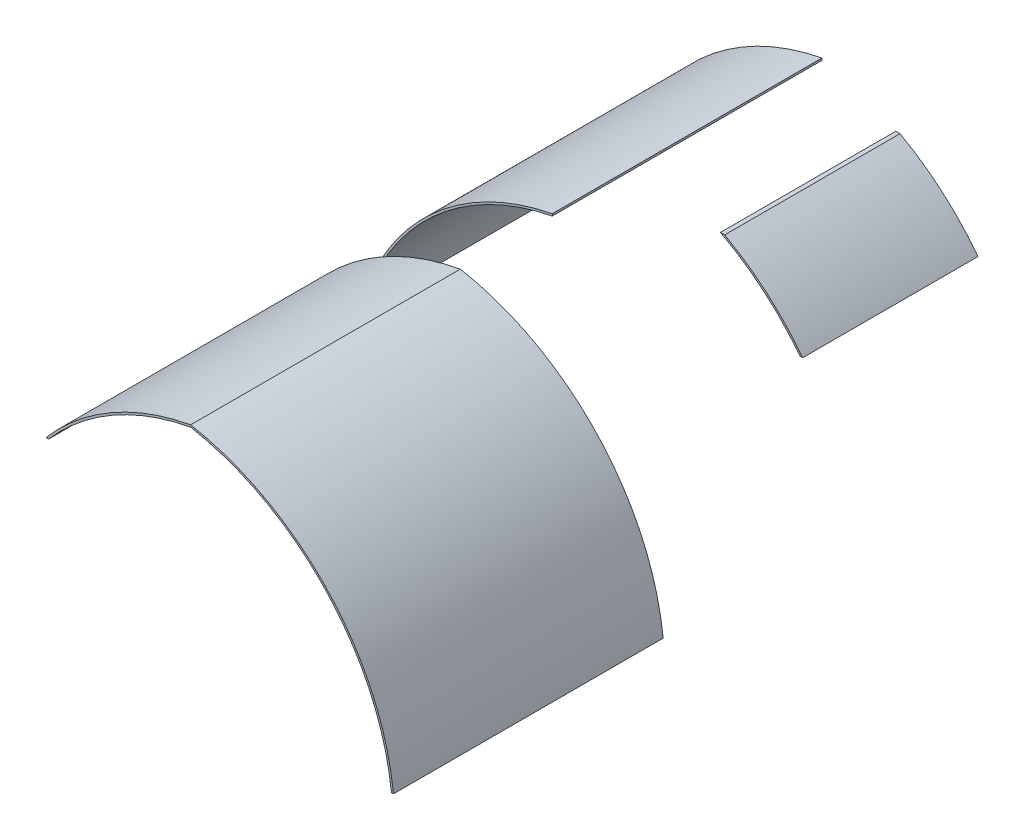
from build123d import *

# Parameters (mm, degrees)
SALIENTE_EXTRUIR1_DEPTH = 6000
CROQUIS2_W              = 1300
CROQUIS2_H              = 500
CORTAR_EXTRUIR2_DEPTH   = 1800
CORTAR_EXTRUIR4_DEPTH   = 1815


with BuildPart() as part:
    # Croquis1 → Saliente-Extruir1 (new body)
    with BuildSketch(Plane.XY):
        with BuildLine():
            Line((-1481.701404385, -91.370616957), (-1496.701404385, -91.370616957))
            ThreePointArc((-1496.701404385, -91.370616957), (-1068.295581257, 1091.797868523), (18.298595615, 1726.409804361))
            ThreePointArc((18.298595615, 1726.409804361), (1104.892772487, 1091.797868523), (1533.298595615, -91.370616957))
            Line((1533.298595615, -91.370616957), (1518.298595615, -91.370616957))
            ThreePointArc((1518.298595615, -91.370616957), (1094.249475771, 1081.138398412), (18.298595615, 1711.158041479))
            ThreePointArc((18.298595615, 1711.158041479), (-1057.652284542, 1081.138398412), (-1481.701404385, -91.370616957))
        make_face()
    extrude(amount=SALIENTE_EXTRUIR1_DEPTH)

    # Croquis2 → Cortar-Extruir2 (cut)
    with BuildSketch(Plane(origin=(1800, 0, 0), x_dir=(0, 0, -1), z_dir=(1, 0, 0))):
        Polygon((-6000, -91.370616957), (0, -91.370616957), (0, 1726.409804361), (-2900, 1726.409804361), (-2900, 108.629383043), (-4900, 108.629383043), (-4900, 1726.409804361), (-6000, 1726.409804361), align=None)
        with Locations((-850, 1276.409804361)):
            Rectangle(CROQUIS2_W, CROQUIS2_H, mode=Mode.SUBTRACT)
    extrude(amount=-CORTAR_EXTRUIR2_DEPTH, mode=Mode.SUBTRACT)


with BuildPart() as cortar_extruir2_piece_1:
    # of the separate pieces the step leaves, piece 1, a body of its own (cortar_extruir2_pieces)
    add(part.part.solids().sort_by_distance((18.298595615, 1726.409804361, 2900))[0])

    # Croquis3 → Cortar-Extruir4 (cut)
    with BuildSketch(Plane(origin=(-1800, 0, 0), x_dir=(0, 0, -1), z_dir=(1, 0, 0))):
        Polygon((0, -91.370616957), (0, 1726.409804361), (-200, 1726.409804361), (-200, 408.629383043), (-2200, 408.629383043), (-2200, 1726.409804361), (-2900, 1726.409804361), (-2900, 1108.629383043), (-4900, 1108.629383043), (-4900, 1726.409804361), (-6000, 1726.409804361), (-6000, -91.370616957), align=None)
    extrude(amount=CORTAR_EXTRUIR4_DEPTH, mode=Mode.SUBTRACT)


with BuildPart() as cortar_extruir2_piece_2:
    # of the separate pieces the step leaves, piece 2, a body of its own (cortar_extruir2_pieces)
    add(part.part.solids().sort_by_distance((578.584800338, 1526.409804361, 1500))[0])


with BuildPart() as cortar_extruir4_piece_1:
    # of the separate pieces the step leaves, piece 1, a body of its own (cortar_extruir4_pieces)
    add(cortar_extruir2_piece_1.part.solids().sort_by_distance((18.298595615, 1726.409804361, 2900))[0])


with BuildPart() as cortar_extruir4_piece_2:
    # of the separate pieces the step leaves, piece 2, a body of its own (cortar_extruir4_pieces)
    add(cortar_extruir2_piece_1.part.solids().sort_by_distance((0, 1722.961938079, 2200))[0])


solid = Compound([cortar_extruir2_piece_2.part, cortar_extruir4_piece_1.part, cortar_extruir4_piece_2.part])
